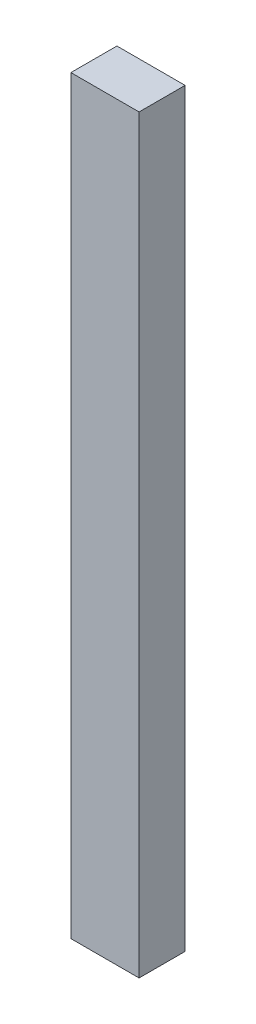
ISO-10303-21;
HEADER;
FILE_DESCRIPTION(('STEP AP214'),'2;1');
FILE_NAME('part.step','',(''),(''),'','','');
FILE_SCHEMA(('AUTOMOTIVE_DESIGN { 1 0 10303 214 1 1 1 1 }'));
ENDSEC;
DATA;
#1=APPLICATION_CONTEXT('core data for automotive mechanical design processes');
#2=APPLICATION_PROTOCOL_DEFINITION('international standard','automotive_design',2000,#1);
#3=PRODUCT_CONTEXT('',#1,'mechanical');
#4=PRODUCT('Part','Part','',(#3));
#5=PRODUCT_RELATED_PRODUCT_CATEGORY('part','',(#4));
#6=PRODUCT_DEFINITION_FORMATION('','',#4);
#7=PRODUCT_DEFINITION_CONTEXT('part definition',#1,'design');
#8=PRODUCT_DEFINITION('design','',#6,#7);
#9=PRODUCT_DEFINITION_SHAPE('','',#8);
#10=(LENGTH_UNIT() NAMED_UNIT(*) SI_UNIT(.MILLI.,.METRE.));
#11=(NAMED_UNIT(*) PLANE_ANGLE_UNIT() SI_UNIT($,.RADIAN.));
#12=(NAMED_UNIT(*) SI_UNIT($,.STERADIAN.) SOLID_ANGLE_UNIT());
#13=UNCERTAINTY_MEASURE_WITH_UNIT(LENGTH_MEASURE(1.E-05),#10,'distance_accuracy_value','');
#14=(GEOMETRIC_REPRESENTATION_CONTEXT(3) GLOBAL_UNCERTAINTY_ASSIGNED_CONTEXT((#13)) GLOBAL_UNIT_ASSIGNED_CONTEXT((#10,
#11,#12)) REPRESENTATION_CONTEXT('',''));
#15=CARTESIAN_POINT('',(0.,0.,0.));
#16=DIRECTION('',(0.,0.,1.));
#17=DIRECTION('',(1.,0.,0.));
#18=AXIS2_PLACEMENT_3D('',#15,#16,#17);
#19=CARTESIAN_POINT('',(410.,480.,-27.));
#20=DIRECTION('',(-1.,0.,0.));
#21=DIRECTION('',(0.,0.,1.));
#22=AXIS2_PLACEMENT_3D('',#19,#20,#21);
#23=PLANE('',#22);
#24=DIRECTION('',(0.,-1.,0.));
#25=VECTOR('',#24,1.);
#26=CARTESIAN_POINT('',(410.,480.,0.));
#27=LINE('',#26,#25);
#28=CARTESIAN_POINT('',(410.,480.,0.));
#29=VERTEX_POINT('',#28);
#30=CARTESIAN_POINT('',(410.,40.,0.));
#31=VERTEX_POINT('',#30);
#32=EDGE_CURVE('E97',#29,#31,#27,.T.);
#33=ORIENTED_EDGE('',*,*,#32,.F.);
#34=DIRECTION('',(0.,0.,1.));
#35=VECTOR('',#34,1.);
#36=CARTESIAN_POINT('',(410.,480.,-27.));
#37=LINE('',#36,#35);
#38=CARTESIAN_POINT('',(410.,480.,-27.));
#39=VERTEX_POINT('',#38);
#40=EDGE_CURVE('E11',#39,#29,#37,.T.);
#41=ORIENTED_EDGE('',*,*,#40,.F.);
#42=DIRECTION('',(0.,-1.,0.));
#43=VECTOR('',#42,1.);
#44=CARTESIAN_POINT('',(410.,480.,-27.));
#45=LINE('',#44,#43);
#46=CARTESIAN_POINT('',(410.,40.,-27.));
#47=VERTEX_POINT('',#46);
#48=EDGE_CURVE('E91',#39,#47,#45,.T.);
#49=ORIENTED_EDGE('',*,*,#48,.T.);
#50=DIRECTION('',(0.,0.,1.));
#51=VECTOR('',#50,1.);
#52=CARTESIAN_POINT('',(410.,40.,-27.));
#53=LINE('',#52,#51);
#54=EDGE_CURVE('E36',#47,#31,#53,.T.);
#55=ORIENTED_EDGE('',*,*,#54,.T.);
#56=EDGE_LOOP('',(#33,#41,#49,#55));
#57=FACE_BOUND('',#56,.T.);
#58=ADVANCED_FACE('F33',(#57),#23,.T.);
#59=CARTESIAN_POINT('',(410.,480.,-27.));
#60=DIRECTION('',(0.,1.,0.));
#61=DIRECTION('',(0.,0.,1.));
#62=AXIS2_PLACEMENT_3D('',#59,#60,#61);
#63=PLANE('',#62);
#64=DIRECTION('',(-1.,0.,0.));
#65=VECTOR('',#64,1.);
#66=CARTESIAN_POINT('',(410.,480.,0.));
#67=LINE('',#66,#65);
#68=CARTESIAN_POINT('',(450.000000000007,480.,0.));
#69=VERTEX_POINT('',#68);
#70=EDGE_CURVE('E93',#69,#29,#67,.T.);
#71=ORIENTED_EDGE('',*,*,#70,.F.);
#72=DIRECTION('',(0.,0.,1.));
#73=VECTOR('',#72,1.);
#74=CARTESIAN_POINT('',(450.000000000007,480.,-27.));
#75=LINE('',#74,#73);
#76=CARTESIAN_POINT('',(450.000000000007,480.,-27.));
#77=VERTEX_POINT('',#76);
#78=EDGE_CURVE('E42',#77,#69,#75,.T.);
#79=ORIENTED_EDGE('',*,*,#78,.F.);
#80=DIRECTION('',(-1.,0.,0.));
#81=VECTOR('',#80,1.);
#82=CARTESIAN_POINT('',(410.,480.,-27.));
#83=LINE('',#82,#81);
#84=EDGE_CURVE('E88',#77,#39,#83,.T.);
#85=ORIENTED_EDGE('',*,*,#84,.T.);
#86=ORIENTED_EDGE('',*,*,#40,.T.);
#87=EDGE_LOOP('',(#71,#79,#85,#86));
#88=FACE_BOUND('',#87,.T.);
#89=ADVANCED_FACE('F107',(#88),#63,.T.);
#90=CARTESIAN_POINT('',(450.000000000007,480.,-27.));
#91=DIRECTION('',(1.,0.,0.));
#92=DIRECTION('',(0.,0.,-1.));
#93=AXIS2_PLACEMENT_3D('',#90,#91,#92);
#94=PLANE('',#93);
#95=DIRECTION('',(0.,1.,0.));
#96=VECTOR('',#95,1.);
#97=CARTESIAN_POINT('',(450.000000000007,480.,0.));
#98=LINE('',#97,#96);
#99=CARTESIAN_POINT('',(450.000000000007,40.,0.));
#100=VERTEX_POINT('',#99);
#101=EDGE_CURVE('E83',#100,#69,#98,.T.);
#102=ORIENTED_EDGE('',*,*,#101,.F.);
#103=DIRECTION('',(0.,0.,1.));
#104=VECTOR('',#103,1.);
#105=CARTESIAN_POINT('',(450.000000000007,40.,-27.));
#106=LINE('',#105,#104);
#107=CARTESIAN_POINT('',(450.000000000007,40.,-27.));
#108=VERTEX_POINT('',#107);
#109=EDGE_CURVE('E78',#108,#100,#106,.T.);
#110=ORIENTED_EDGE('',*,*,#109,.F.);
#111=DIRECTION('',(0.,1.,0.));
#112=VECTOR('',#111,1.);
#113=CARTESIAN_POINT('',(450.000000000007,480.,-27.));
#114=LINE('',#113,#112);
#115=EDGE_CURVE('E81',#108,#77,#114,.T.);
#116=ORIENTED_EDGE('',*,*,#115,.T.);
#117=ORIENTED_EDGE('',*,*,#78,.T.);
#118=EDGE_LOOP('',(#102,#110,#116,#117));
#119=FACE_BOUND('',#118,.T.);
#120=ADVANCED_FACE('F80',(#119),#94,.T.);
#121=CARTESIAN_POINT('',(410.,40.,-27.));
#122=DIRECTION('',(0.,-1.,0.));
#123=DIRECTION('',(0.,0.,-1.));
#124=AXIS2_PLACEMENT_3D('',#121,#122,#123);
#125=PLANE('',#124);
#126=DIRECTION('',(1.,0.,0.));
#127=VECTOR('',#126,1.);
#128=CARTESIAN_POINT('',(410.,40.,0.));
#129=LINE('',#128,#127);
#130=EDGE_CURVE('E100',#31,#100,#129,.T.);
#131=ORIENTED_EDGE('',*,*,#130,.F.);
#132=ORIENTED_EDGE('',*,*,#54,.F.);
#133=DIRECTION('',(1.,0.,0.));
#134=VECTOR('',#133,1.);
#135=CARTESIAN_POINT('',(410.,40.,-27.));
#136=LINE('',#135,#134);
#137=EDGE_CURVE('E87',#47,#108,#136,.T.);
#138=ORIENTED_EDGE('',*,*,#137,.T.);
#139=ORIENTED_EDGE('',*,*,#109,.T.);
#140=EDGE_LOOP('',(#131,#132,#138,#139));
#141=FACE_BOUND('',#140,.T.);
#142=ADVANCED_FACE('F90',(#141),#125,.T.);
#143=CARTESIAN_POINT('',(0.,0.,-27.));
#144=DIRECTION('',(0.,0.,1.));
#145=DIRECTION('',(1.,0.,0.));
#146=AXIS2_PLACEMENT_3D('',#143,#144,#145);
#147=PLANE('',#146);
#148=ORIENTED_EDGE('',*,*,#48,.F.);
#149=ORIENTED_EDGE('',*,*,#84,.F.);
#150=ORIENTED_EDGE('',*,*,#115,.F.);
#151=ORIENTED_EDGE('',*,*,#137,.F.);
#152=EDGE_LOOP('',(#148,#149,#150,#151));
#153=FACE_BOUND('',#152,.T.);
#154=ADVANCED_FACE('F86',(#153),#147,.F.);
#155=CARTESIAN_POINT('',(0.,0.,0.));
#156=DIRECTION('',(0.,0.,1.));
#157=DIRECTION('',(1.,0.,0.));
#158=AXIS2_PLACEMENT_3D('',#155,#156,#157);
#159=PLANE('',#158);
#160=ORIENTED_EDGE('',*,*,#32,.T.);
#161=ORIENTED_EDGE('',*,*,#130,.T.);
#162=ORIENTED_EDGE('',*,*,#101,.T.);
#163=ORIENTED_EDGE('',*,*,#70,.T.);
#164=EDGE_LOOP('',(#160,#161,#162,#163));
#165=FACE_BOUND('',#164,.T.);
#166=ADVANCED_FACE('F106',(#165),#159,.T.);
#167=CLOSED_SHELL('',(#58,#89,#120,#142,#154,#166));
#168=MANIFOLD_SOLID_BREP('B2',#167);
#169=ADVANCED_BREP_SHAPE_REPRESENTATION('',(#18,#168),#14);
#170=SHAPE_DEFINITION_REPRESENTATION(#9,#169);
ENDSEC;
END-ISO-10303-21;
